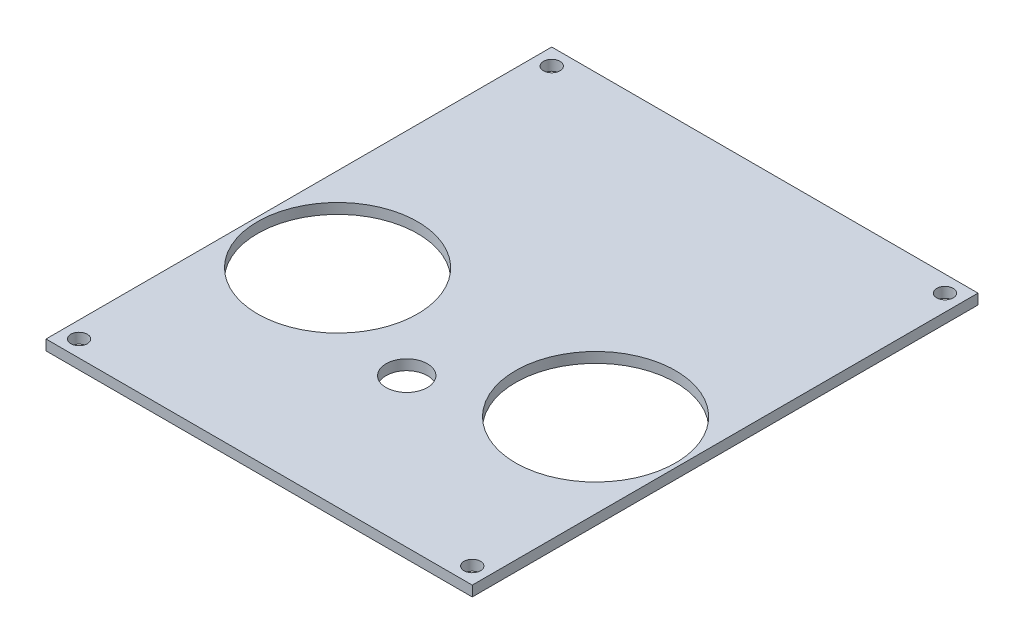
from build123d import *

# Parameters (mm, degrees)
SKETCH1_W                  = 82.6
SKETCH1_H                  = 98
BOSS_EXTRUDE1_DEPTH        = 2
F_3_2_3_2_DIAMETER_HOLE1_D = 3.2
SKETCH4_R                  = 15.5
CUT_EXTRUDE1_DEPTH         = 2
SKETCH5_R                  = 4
CUT_EXTRUDE2_DEPTH         = 10


with BuildPart() as part:
    # Sketch1 → Boss-Extrude1 (new body)
    with BuildSketch(Plane(origin=(0, 0, 0), x_dir=(1, 0, 0), z_dir=(0, 1, 0))):
        Rectangle(SKETCH1_W, SKETCH1_H)
    extrude(amount=BOSS_EXTRUDE1_DEPTH)

    # 3.2 _3.2_ Diameter Hole1 (through all)
    with Locations(Plane(origin=(0, 2, 0), x_dir=(1, 0, 0), z_dir=(0, 1, 0))):
        with Locations((-38.1, 45.8), (38.1, 45.8), (38.1, -45.8), (-38.1, -45.8)):
            Hole(F_3_2_3_2_DIAMETER_HOLE1_D / 2)

    # Sketch4 → Cut-Extrude1 (cut)
    with BuildSketch(Plane(origin=(0, 2, 0), x_dir=(1, 0, 0), z_dir=(0, 1, 0))):
        with Locations(Location((-25, -8.8, 0), (0, 0, 270))):
            Circle(SKETCH4_R)
        with Locations(Location((25, -8.8, 0), (0, 0, 270))):
            Circle(SKETCH4_R)
    extrude(amount=-CUT_EXTRUDE1_DEPTH, mode=Mode.SUBTRACT)

    # Sketch5 → Cut-Extrude2 (cut)
    with BuildSketch(Plane.XZ):
        with Locations(Location((-0.2, 20.2, 0), (0, 0, 270))):
            Circle(SKETCH5_R)
    extrude(amount=-CUT_EXTRUDE2_DEPTH, mode=Mode.SUBTRACT)


solid = part.part
